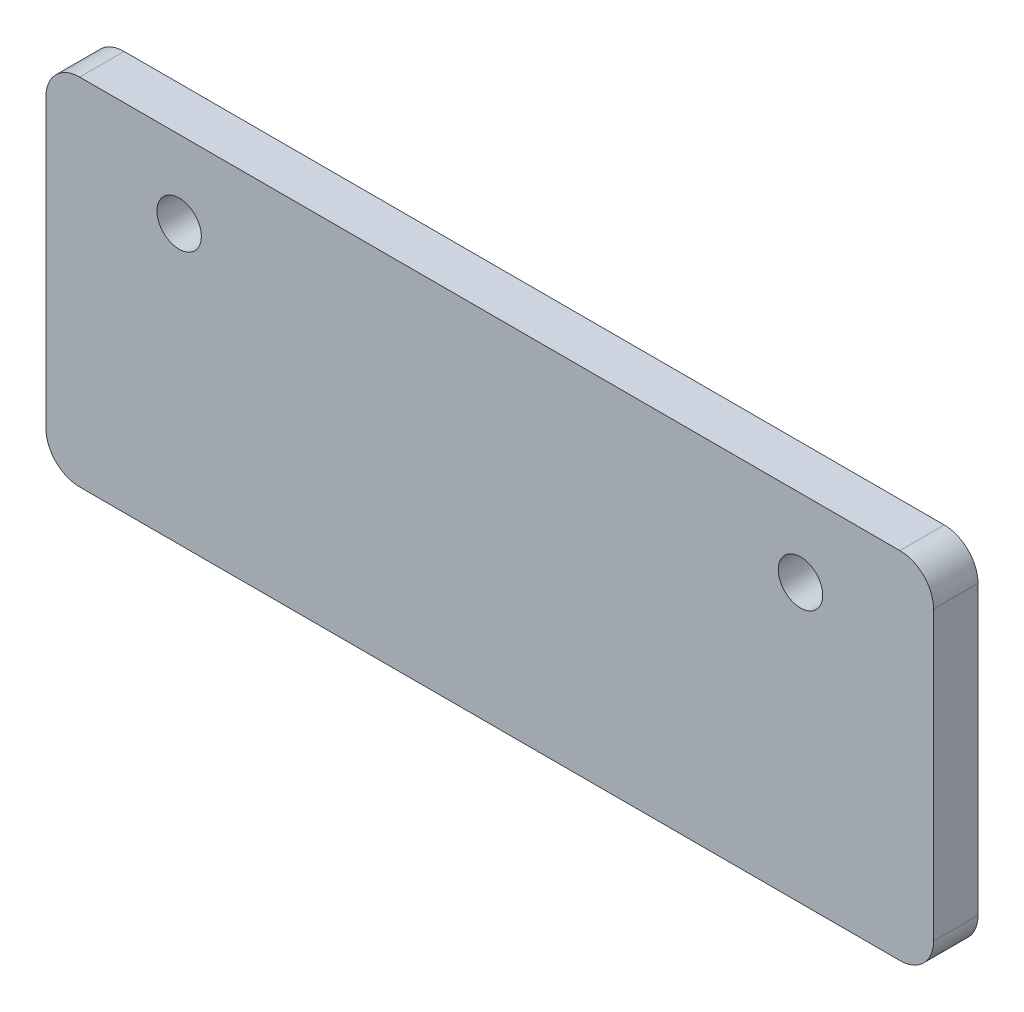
from build123d import *

# Parameters (mm, degrees)
SKETCH1_R      = 6.35
EXTRUDE1_DEPTH = 6.35


with BuildPart() as part:
    # Sketch1 → Extrude1 (new, symmetric)
    with BuildSketch(Plane.XY):
        with BuildLine():
            Line((0, -41.148), (0, 41.148))
            ThreePointArc((0, 41.148), (2.827005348, 47.972994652), (9.652, 50.8))
            Line((9.652, 50.8), (244.348, 50.8))
            ThreePointArc((244.348, 50.8), (251.172994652, 47.972994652), (254, 41.148))
            Line((254, 41.148), (254, -41.148))
            ThreePointArc((254, -41.148), (251.172994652, -47.972994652), (244.348, -50.8))
            Line((244.348, -50.8), (9.652, -50.8))
            ThreePointArc((9.652, -50.8), (2.827005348, -47.972994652), (0, -41.148))
        make_face()
        with Locations((215.9, 28.702)):
            Circle(SKETCH1_R, mode=Mode.SUBTRACT)
        with Locations((38.1, 28.702)):
            Circle(SKETCH1_R, mode=Mode.SUBTRACT)
    extrude(amount=EXTRUDE1_DEPTH, both=True)


solid = part.part
